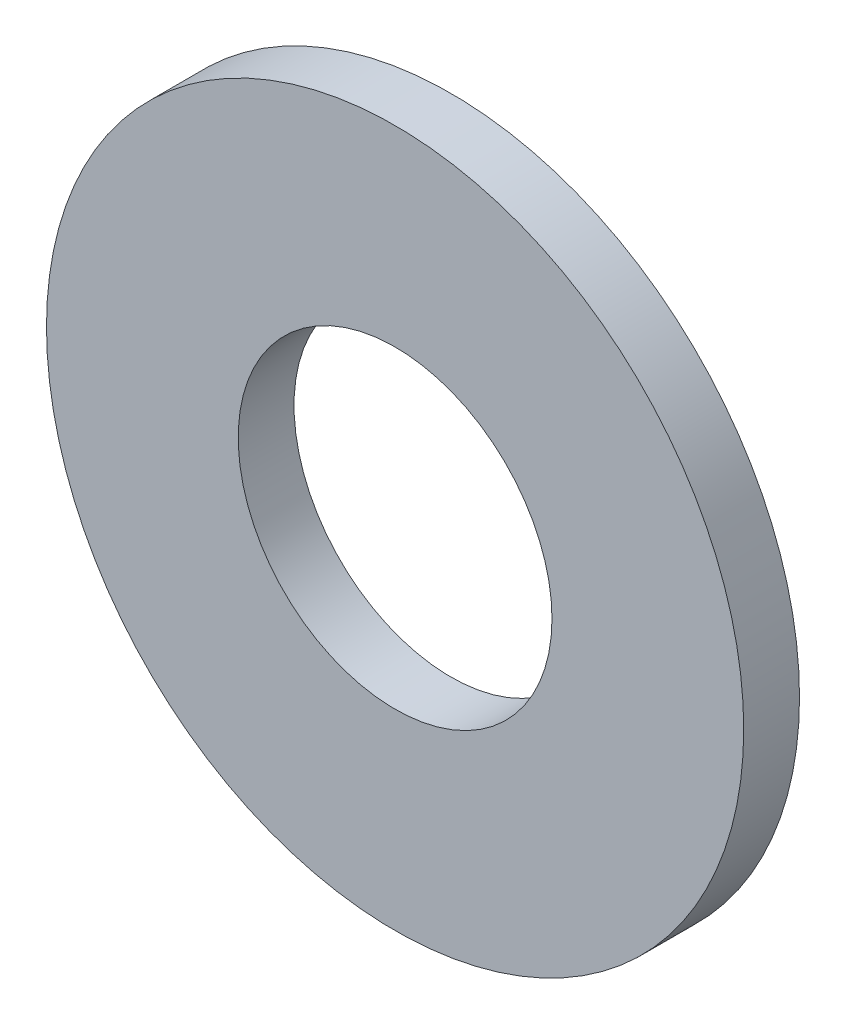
from build123d import *

# Parameters (mm, degrees)
SKETCH1_R      = 7.9375
SKETCH1_R_2    = 3.571875
EXTRUDE1_DEPTH = 1.27


with BuildPart() as part:
    # Sketch1 → Extrude1 (new body)
    with BuildSketch(Plane.XY):
        Circle(SKETCH1_R)
        Circle(SKETCH1_R_2, mode=Mode.SUBTRACT)
    extrude(amount=-EXTRUDE1_DEPTH)


solid = part.part
